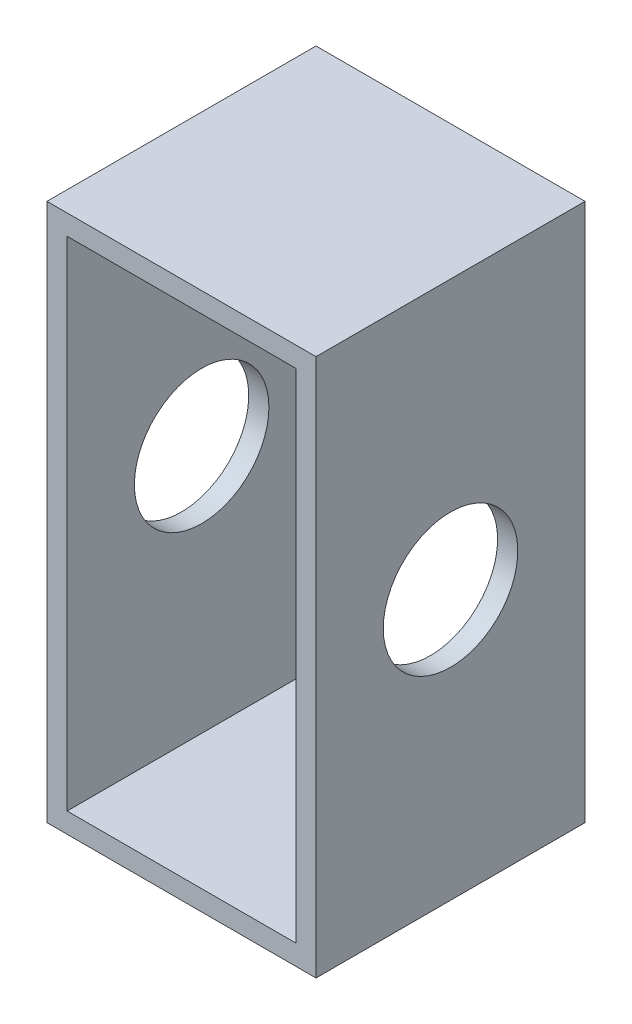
ISO-10303-21;
HEADER;
FILE_DESCRIPTION(('STEP AP214'),'2;1');
FILE_NAME('part.step','',(''),(''),'','','');
FILE_SCHEMA(('AUTOMOTIVE_DESIGN { 1 0 10303 214 1 1 1 1 }'));
ENDSEC;
DATA;
#1=APPLICATION_CONTEXT('core data for automotive mechanical design processes');
#2=APPLICATION_PROTOCOL_DEFINITION('international standard','automotive_design',2000,#1);
#3=PRODUCT_CONTEXT('',#1,'mechanical');
#4=PRODUCT('Part','Part','',(#3));
#5=PRODUCT_RELATED_PRODUCT_CATEGORY('part','',(#4));
#6=PRODUCT_DEFINITION_FORMATION('','',#4);
#7=PRODUCT_DEFINITION_CONTEXT('part definition',#1,'design');
#8=PRODUCT_DEFINITION('design','',#6,#7);
#9=PRODUCT_DEFINITION_SHAPE('','',#8);
#10=(LENGTH_UNIT() NAMED_UNIT(*) SI_UNIT(.MILLI.,.METRE.));
#11=(NAMED_UNIT(*) PLANE_ANGLE_UNIT() SI_UNIT($,.RADIAN.));
#12=(NAMED_UNIT(*) SI_UNIT($,.STERADIAN.) SOLID_ANGLE_UNIT());
#13=UNCERTAINTY_MEASURE_WITH_UNIT(LENGTH_MEASURE(1.E-05),#10,'distance_accuracy_value','');
#14=(GEOMETRIC_REPRESENTATION_CONTEXT(3) GLOBAL_UNCERTAINTY_ASSIGNED_CONTEXT((#13)) GLOBAL_UNIT_ASSIGNED_CONTEXT((#10,
#11,#12)) REPRESENTATION_CONTEXT('',''));
#15=CARTESIAN_POINT('',(0.,0.,0.));
#16=DIRECTION('',(0.,0.,1.));
#17=DIRECTION('',(1.,0.,0.));
#18=AXIS2_PLACEMENT_3D('',#15,#16,#17);
#19=CARTESIAN_POINT('',(0.,0.,20.));
#20=DIRECTION('',(0.,0.,1.));
#21=DIRECTION('',(1.,0.,0.));
#22=AXIS2_PLACEMENT_3D('',#19,#20,#21);
#23=PLANE('',#22);
#24=DIRECTION('',(0.,-1.,0.));
#25=VECTOR('',#24,1.);
#26=CARTESIAN_POINT('',(-20.,-40.,20.));
#27=LINE('',#26,#25);
#28=CARTESIAN_POINT('',(-20.,40.,20.));
#29=VERTEX_POINT('',#28);
#30=CARTESIAN_POINT('',(-20.,-40.,20.));
#31=VERTEX_POINT('',#30);
#32=EDGE_CURVE('E156',#29,#31,#27,.T.);
#33=ORIENTED_EDGE('',*,*,#32,.T.);
#34=DIRECTION('',(1.,0.,0.));
#35=VECTOR('',#34,1.);
#36=CARTESIAN_POINT('',(20.,-40.,20.));
#37=LINE('',#36,#35);
#38=CARTESIAN_POINT('',(20.,-40.,20.));
#39=VERTEX_POINT('',#38);
#40=EDGE_CURVE('E160',#31,#39,#37,.T.);
#41=ORIENTED_EDGE('',*,*,#40,.T.);
#42=DIRECTION('',(0.,1.,0.));
#43=VECTOR('',#42,1.);
#44=CARTESIAN_POINT('',(20.,-40.,20.));
#45=LINE('',#44,#43);
#46=CARTESIAN_POINT('',(20.,40.,20.));
#47=VERTEX_POINT('',#46);
#48=EDGE_CURVE('E164',#39,#47,#45,.T.);
#49=ORIENTED_EDGE('',*,*,#48,.T.);
#50=DIRECTION('',(-1.,0.,0.));
#51=VECTOR('',#50,1.);
#52=CARTESIAN_POINT('',(20.,40.,20.));
#53=LINE('',#52,#51);
#54=EDGE_CURVE('E167',#47,#29,#53,.T.);
#55=ORIENTED_EDGE('',*,*,#54,.T.);
#56=EDGE_LOOP('',(#33,#41,#49,#55));
#57=FACE_BOUND('',#56,.T.);
#58=DIRECTION('',(1.,0.,0.));
#59=VECTOR('',#58,1.);
#60=CARTESIAN_POINT('',(17.,-37.,20.));
#61=LINE('',#60,#59);
#62=CARTESIAN_POINT('',(-17.,-37.,20.));
#63=VERTEX_POINT('',#62);
#64=CARTESIAN_POINT('',(17.,-37.,20.));
#65=VERTEX_POINT('',#64);
#66=EDGE_CURVE('E115',#63,#65,#61,.T.);
#67=ORIENTED_EDGE('',*,*,#66,.F.);
#68=DIRECTION('',(0.,-1.,0.));
#69=VECTOR('',#68,1.);
#70=CARTESIAN_POINT('',(-17.,-37.,20.));
#71=LINE('',#70,#69);
#72=CARTESIAN_POINT('',(-17.,37.,20.));
#73=VERTEX_POINT('',#72);
#74=EDGE_CURVE('E106',#73,#63,#71,.T.);
#75=ORIENTED_EDGE('',*,*,#74,.F.);
#76=DIRECTION('',(-1.,0.,0.));
#77=VECTOR('',#76,1.);
#78=CARTESIAN_POINT('',(17.,37.,20.));
#79=LINE('',#78,#77);
#80=CARTESIAN_POINT('',(17.,37.,20.));
#81=VERTEX_POINT('',#80);
#82=EDGE_CURVE('E132',#81,#73,#79,.T.);
#83=ORIENTED_EDGE('',*,*,#82,.F.);
#84=DIRECTION('',(0.,1.,0.));
#85=VECTOR('',#84,1.);
#86=CARTESIAN_POINT('',(17.,-37.,20.));
#87=LINE('',#86,#85);
#88=EDGE_CURVE('E128',#65,#81,#87,.T.);
#89=ORIENTED_EDGE('',*,*,#88,.F.);
#90=EDGE_LOOP('',(#67,#75,#83,#89));
#91=FACE_BOUND('',#90,.T.);
#92=ADVANCED_FACE('F39',(#57,#91),#23,.T.);
#93=CARTESIAN_POINT('',(0.,0.,-20.));
#94=DIRECTION('',(0.,0.,1.));
#95=DIRECTION('',(1.,0.,0.));
#96=AXIS2_PLACEMENT_3D('',#93,#94,#95);
#97=PLANE('',#96);
#98=DIRECTION('',(0.,-1.,0.));
#99=VECTOR('',#98,1.);
#100=CARTESIAN_POINT('',(-20.,-40.,-20.));
#101=LINE('',#100,#99);
#102=CARTESIAN_POINT('',(-20.,40.,-20.));
#103=VERTEX_POINT('',#102);
#104=CARTESIAN_POINT('',(-20.,-40.,-20.));
#105=VERTEX_POINT('',#104);
#106=EDGE_CURVE('E124',#103,#105,#101,.T.);
#107=ORIENTED_EDGE('',*,*,#106,.F.);
#108=DIRECTION('',(-1.,0.,0.));
#109=VECTOR('',#108,1.);
#110=CARTESIAN_POINT('',(20.,40.,-20.));
#111=LINE('',#110,#109);
#112=CARTESIAN_POINT('',(20.,40.,-20.));
#113=VERTEX_POINT('',#112);
#114=EDGE_CURVE('E161',#113,#103,#111,.T.);
#115=ORIENTED_EDGE('',*,*,#114,.F.);
#116=DIRECTION('',(0.,1.,0.));
#117=VECTOR('',#116,1.);
#118=CARTESIAN_POINT('',(20.,-40.,-20.));
#119=LINE('',#118,#117);
#120=CARTESIAN_POINT('',(20.,-40.,-20.));
#121=VERTEX_POINT('',#120);
#122=EDGE_CURVE('E177',#121,#113,#119,.T.);
#123=ORIENTED_EDGE('',*,*,#122,.F.);
#124=DIRECTION('',(1.,0.,0.));
#125=VECTOR('',#124,1.);
#126=CARTESIAN_POINT('',(20.,-40.,-20.));
#127=LINE('',#126,#125);
#128=EDGE_CURVE('E174',#105,#121,#127,.T.);
#129=ORIENTED_EDGE('',*,*,#128,.F.);
#130=EDGE_LOOP('',(#107,#115,#123,#129));
#131=FACE_BOUND('',#130,.T.);
#132=DIRECTION('',(0.,-1.,0.));
#133=VECTOR('',#132,1.);
#134=CARTESIAN_POINT('',(-17.,-37.,-20.));
#135=LINE('',#134,#133);
#136=CARTESIAN_POINT('',(-17.,37.,-20.));
#137=VERTEX_POINT('',#136);
#138=CARTESIAN_POINT('',(-17.,-37.,-20.));
#139=VERTEX_POINT('',#138);
#140=EDGE_CURVE('E64',#137,#139,#135,.T.);
#141=ORIENTED_EDGE('',*,*,#140,.T.);
#142=DIRECTION('',(1.,0.,0.));
#143=VECTOR('',#142,1.);
#144=CARTESIAN_POINT('',(17.,-37.,-20.));
#145=LINE('',#144,#143);
#146=CARTESIAN_POINT('',(17.,-37.,-20.));
#147=VERTEX_POINT('',#146);
#148=EDGE_CURVE('E122',#139,#147,#145,.T.);
#149=ORIENTED_EDGE('',*,*,#148,.T.);
#150=DIRECTION('',(0.,1.,0.));
#151=VECTOR('',#150,1.);
#152=CARTESIAN_POINT('',(17.,-37.,-20.));
#153=LINE('',#152,#151);
#154=CARTESIAN_POINT('',(17.,37.,-20.));
#155=VERTEX_POINT('',#154);
#156=EDGE_CURVE('E143',#147,#155,#153,.T.);
#157=ORIENTED_EDGE('',*,*,#156,.T.);
#158=DIRECTION('',(-1.,0.,0.));
#159=VECTOR('',#158,1.);
#160=CARTESIAN_POINT('',(17.,37.,-20.));
#161=LINE('',#160,#159);
#162=EDGE_CURVE('E116',#155,#137,#161,.T.);
#163=ORIENTED_EDGE('',*,*,#162,.T.);
#164=EDGE_LOOP('',(#141,#149,#157,#163));
#165=FACE_BOUND('',#164,.T.);
#166=ADVANCED_FACE('F201',(#131,#165),#97,.F.);
#167=CARTESIAN_POINT('',(-20.,-40.,20.));
#168=DIRECTION('',(1.,0.,0.));
#169=DIRECTION('',(0.,0.,-1.));
#170=AXIS2_PLACEMENT_3D('',#167,#168,#169);
#171=PLANE('',#170);
#172=CARTESIAN_POINT('',(-20.,0.,0.));
#173=DIRECTION('',(-1.,0.,0.));
#174=DIRECTION('',(0.,0.,1.));
#175=AXIS2_PLACEMENT_3D('',#172,#173,#174);
#176=CIRCLE('',#175,10.);
#177=CARTESIAN_POINT('',(-20.,0.,10.));
#178=VERTEX_POINT('',#177);
#179=EDGE_CURVE('E249',#178,#178,#176,.T.);
#180=ORIENTED_EDGE('',*,*,#179,.F.);
#181=EDGE_LOOP('',(#180));
#182=FACE_BOUND('',#181,.T.);
#183=ORIENTED_EDGE('',*,*,#106,.T.);
#184=DIRECTION('',(0.,0.,-1.));
#185=VECTOR('',#184,1.);
#186=CARTESIAN_POINT('',(-20.,-40.,20.));
#187=LINE('',#186,#185);
#188=EDGE_CURVE('E11',#31,#105,#187,.T.);
#189=ORIENTED_EDGE('',*,*,#188,.F.);
#190=ORIENTED_EDGE('',*,*,#32,.F.);
#191=DIRECTION('',(0.,0.,-1.));
#192=VECTOR('',#191,1.);
#193=CARTESIAN_POINT('',(-20.,40.,20.));
#194=LINE('',#193,#192);
#195=EDGE_CURVE('E170',#29,#103,#194,.T.);
#196=ORIENTED_EDGE('',*,*,#195,.T.);
#197=EDGE_LOOP('',(#183,#189,#190,#196));
#198=FACE_BOUND('',#197,.T.);
#199=ADVANCED_FACE('F41',(#182,#198),#171,.F.);
#200=CARTESIAN_POINT('',(20.,-40.,20.));
#201=DIRECTION('',(0.,1.,0.));
#202=DIRECTION('',(-1.,0.,0.));
#203=AXIS2_PLACEMENT_3D('',#200,#201,#202);
#204=PLANE('',#203);
#205=ORIENTED_EDGE('',*,*,#128,.T.);
#206=DIRECTION('',(0.,0.,-1.));
#207=VECTOR('',#206,1.);
#208=CARTESIAN_POINT('',(20.,-40.,20.));
#209=LINE('',#208,#207);
#210=EDGE_CURVE('E49',#39,#121,#209,.T.);
#211=ORIENTED_EDGE('',*,*,#210,.F.);
#212=ORIENTED_EDGE('',*,*,#40,.F.);
#213=ORIENTED_EDGE('',*,*,#188,.T.);
#214=EDGE_LOOP('',(#205,#211,#212,#213));
#215=FACE_BOUND('',#214,.T.);
#216=ADVANCED_FACE('F211',(#215),#204,.F.);
#217=CARTESIAN_POINT('',(20.,-40.,20.));
#218=DIRECTION('',(-1.,0.,0.));
#219=DIRECTION('',(0.,0.,1.));
#220=AXIS2_PLACEMENT_3D('',#217,#218,#219);
#221=PLANE('',#220);
#222=CARTESIAN_POINT('',(20.,0.,0.));
#223=DIRECTION('',(-1.,0.,0.));
#224=DIRECTION('',(0.,0.,1.));
#225=AXIS2_PLACEMENT_3D('',#222,#223,#224);
#226=CIRCLE('',#225,10.);
#227=CARTESIAN_POINT('',(20.,0.,10.));
#228=VERTEX_POINT('',#227);
#229=EDGE_CURVE('E244',#228,#228,#226,.F.);
#230=ORIENTED_EDGE('',*,*,#229,.F.);
#231=EDGE_LOOP('',(#230));
#232=FACE_BOUND('',#231,.T.);
#233=ORIENTED_EDGE('',*,*,#122,.T.);
#234=DIRECTION('',(0.,0.,-1.));
#235=VECTOR('',#234,1.);
#236=CARTESIAN_POINT('',(20.,40.,20.));
#237=LINE('',#236,#235);
#238=EDGE_CURVE('E185',#47,#113,#237,.T.);
#239=ORIENTED_EDGE('',*,*,#238,.F.);
#240=ORIENTED_EDGE('',*,*,#48,.F.);
#241=ORIENTED_EDGE('',*,*,#210,.T.);
#242=EDGE_LOOP('',(#233,#239,#240,#241));
#243=FACE_BOUND('',#242,.T.);
#244=ADVANCED_FACE('F195',(#232,#243),#221,.F.);
#245=CARTESIAN_POINT('',(20.,40.,20.));
#246=DIRECTION('',(0.,-1.,0.));
#247=DIRECTION('',(0.,0.,-1.));
#248=AXIS2_PLACEMENT_3D('',#245,#246,#247);
#249=PLANE('',#248);
#250=ORIENTED_EDGE('',*,*,#114,.T.);
#251=ORIENTED_EDGE('',*,*,#195,.F.);
#252=ORIENTED_EDGE('',*,*,#54,.F.);
#253=ORIENTED_EDGE('',*,*,#238,.T.);
#254=EDGE_LOOP('',(#250,#251,#252,#253));
#255=FACE_BOUND('',#254,.T.);
#256=ADVANCED_FACE('F205',(#255),#249,.F.);
#257=CARTESIAN_POINT('',(-17.,-37.,20.));
#258=DIRECTION('',(1.,0.,0.));
#259=DIRECTION('',(0.,0.,-1.));
#260=AXIS2_PLACEMENT_3D('',#257,#258,#259);
#261=PLANE('',#260);
#262=CARTESIAN_POINT('',(-17.,0.,0.));
#263=DIRECTION('',(1.,0.,0.));
#264=DIRECTION('',(0.,0.,-1.));
#265=AXIS2_PLACEMENT_3D('',#262,#263,#264);
#266=CIRCLE('',#265,10.);
#267=CARTESIAN_POINT('',(-17.,0.,-10.));
#268=VERTEX_POINT('',#267);
#269=EDGE_CURVE('E140',#268,#268,#266,.T.);
#270=ORIENTED_EDGE('',*,*,#269,.F.);
#271=EDGE_LOOP('',(#270));
#272=FACE_BOUND('',#271,.T.);
#273=ORIENTED_EDGE('',*,*,#140,.F.);
#274=DIRECTION('',(0.,0.,-1.));
#275=VECTOR('',#274,1.);
#276=CARTESIAN_POINT('',(-17.,37.,20.));
#277=LINE('',#276,#275);
#278=EDGE_CURVE('E110',#73,#137,#277,.T.);
#279=ORIENTED_EDGE('',*,*,#278,.F.);
#280=ORIENTED_EDGE('',*,*,#74,.T.);
#281=DIRECTION('',(0.,0.,-1.));
#282=VECTOR('',#281,1.);
#283=CARTESIAN_POINT('',(-17.,-37.,20.));
#284=LINE('',#283,#282);
#285=EDGE_CURVE('E109',#63,#139,#284,.T.);
#286=ORIENTED_EDGE('',*,*,#285,.T.);
#287=EDGE_LOOP('',(#273,#279,#280,#286));
#288=FACE_BOUND('',#287,.T.);
#289=ADVANCED_FACE('F108',(#272,#288),#261,.T.);
#290=CARTESIAN_POINT('',(17.,-37.,20.));
#291=DIRECTION('',(0.,1.,0.));
#292=DIRECTION('',(0.,0.,1.));
#293=AXIS2_PLACEMENT_3D('',#290,#291,#292);
#294=PLANE('',#293);
#295=ORIENTED_EDGE('',*,*,#148,.F.);
#296=ORIENTED_EDGE('',*,*,#285,.F.);
#297=ORIENTED_EDGE('',*,*,#66,.T.);
#298=DIRECTION('',(0.,0.,-1.));
#299=VECTOR('',#298,1.);
#300=CARTESIAN_POINT('',(17.,-37.,20.));
#301=LINE('',#300,#299);
#302=EDGE_CURVE('E125',#65,#147,#301,.T.);
#303=ORIENTED_EDGE('',*,*,#302,.T.);
#304=EDGE_LOOP('',(#295,#296,#297,#303));
#305=FACE_BOUND('',#304,.T.);
#306=ADVANCED_FACE('F119',(#305),#294,.T.);
#307=CARTESIAN_POINT('',(17.,-37.,20.));
#308=DIRECTION('',(-1.,0.,0.));
#309=DIRECTION('',(0.,0.,1.));
#310=AXIS2_PLACEMENT_3D('',#307,#308,#309);
#311=PLANE('',#310);
#312=CARTESIAN_POINT('',(17.,0.,0.));
#313=DIRECTION('',(-1.,0.,0.));
#314=DIRECTION('',(0.,0.,1.));
#315=AXIS2_PLACEMENT_3D('',#312,#313,#314);
#316=CIRCLE('',#315,10.);
#317=CARTESIAN_POINT('',(17.,0.,10.));
#318=VERTEX_POINT('',#317);
#319=EDGE_CURVE('E43',#318,#318,#316,.T.);
#320=ORIENTED_EDGE('',*,*,#319,.F.);
#321=EDGE_LOOP('',(#320));
#322=FACE_BOUND('',#321,.T.);
#323=ORIENTED_EDGE('',*,*,#156,.F.);
#324=ORIENTED_EDGE('',*,*,#302,.F.);
#325=ORIENTED_EDGE('',*,*,#88,.T.);
#326=DIRECTION('',(0.,0.,-1.));
#327=VECTOR('',#326,1.);
#328=CARTESIAN_POINT('',(17.,37.,20.));
#329=LINE('',#328,#327);
#330=EDGE_CURVE('E56',#81,#155,#329,.T.);
#331=ORIENTED_EDGE('',*,*,#330,.T.);
#332=EDGE_LOOP('',(#323,#324,#325,#331));
#333=FACE_BOUND('',#332,.T.);
#334=ADVANCED_FACE('F237',(#322,#333),#311,.T.);
#335=CARTESIAN_POINT('',(17.,37.,20.));
#336=DIRECTION('',(0.,-1.,0.));
#337=DIRECTION('',(0.,0.,-1.));
#338=AXIS2_PLACEMENT_3D('',#335,#336,#337);
#339=PLANE('',#338);
#340=ORIENTED_EDGE('',*,*,#162,.F.);
#341=ORIENTED_EDGE('',*,*,#330,.F.);
#342=ORIENTED_EDGE('',*,*,#82,.T.);
#343=ORIENTED_EDGE('',*,*,#278,.T.);
#344=EDGE_LOOP('',(#340,#341,#342,#343));
#345=FACE_BOUND('',#344,.T.);
#346=ADVANCED_FACE('F261',(#345),#339,.T.);
#347=CARTESIAN_POINT('',(48.2842712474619,0.,0.));
#348=DIRECTION('',(-1.,0.,0.));
#349=DIRECTION('',(0.,0.,1.));
#350=AXIS2_PLACEMENT_3D('',#347,#348,#349);
#351=CYLINDRICAL_SURFACE('',#350,10.);
#352=ORIENTED_EDGE('',*,*,#319,.T.);
#353=EDGE_LOOP('',(#352));
#354=FACE_BOUND('',#353,.T.);
#355=ORIENTED_EDGE('',*,*,#229,.T.);
#356=EDGE_LOOP('',(#355));
#357=FACE_BOUND('',#356,.T.);
#358=ADVANCED_FACE('F256',(#354,#357),#351,.F.);
#359=ORIENTED_EDGE('',*,*,#269,.T.);
#360=EDGE_LOOP('',(#359));
#361=FACE_BOUND('',#360,.T.);
#362=ORIENTED_EDGE('',*,*,#179,.T.);
#363=EDGE_LOOP('',(#362));
#364=FACE_BOUND('',#363,.T.);
#365=ADVANCED_FACE('F254',(#361,#364),#351,.F.);
#366=CLOSED_SHELL('',(#92,#166,#199,#216,#244,#256,#289,#306,#334,#346,#358,#365));
#367=MANIFOLD_SOLID_BREP('B2',#366);
#368=ADVANCED_BREP_SHAPE_REPRESENTATION('',(#18,#367),#14);
#369=SHAPE_DEFINITION_REPRESENTATION(#9,#368);
ENDSEC;
END-ISO-10303-21;
